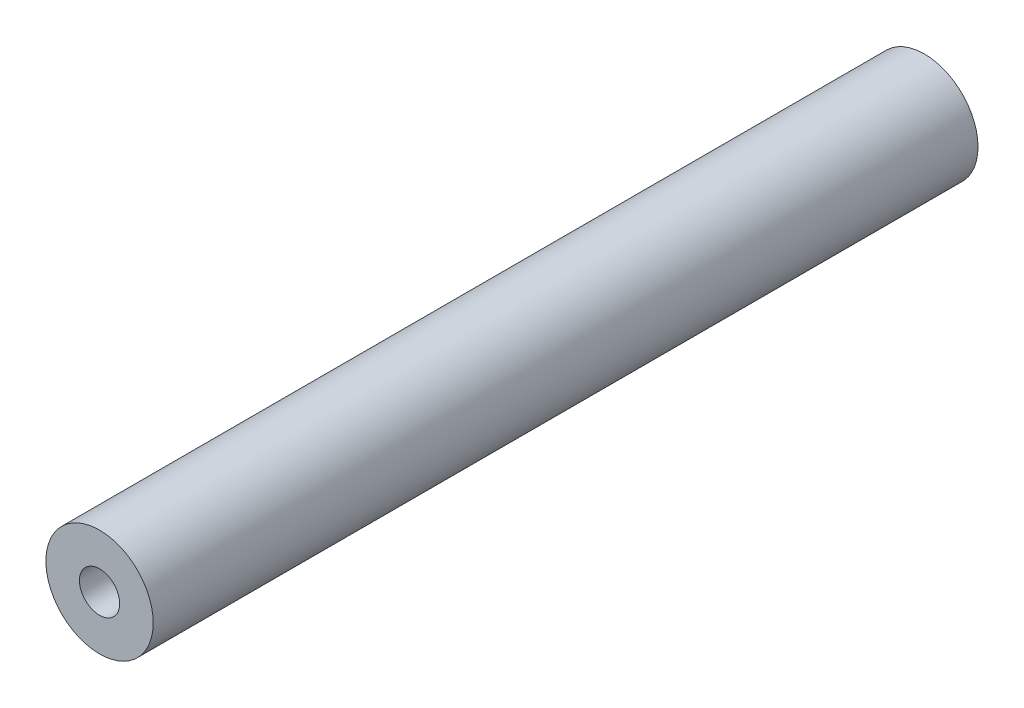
ISO-10303-21;
HEADER;
FILE_DESCRIPTION(('STEP AP214'),'2;1');
FILE_NAME('part.step','',(''),(''),'','','');
FILE_SCHEMA(('AUTOMOTIVE_DESIGN { 1 0 10303 214 1 1 1 1 }'));
ENDSEC;
DATA;
#1=APPLICATION_CONTEXT('core data for automotive mechanical design processes');
#2=APPLICATION_PROTOCOL_DEFINITION('international standard','automotive_design',2000,#1);
#3=PRODUCT_CONTEXT('',#1,'mechanical');
#4=PRODUCT('Part','Part','',(#3));
#5=PRODUCT_RELATED_PRODUCT_CATEGORY('part','',(#4));
#6=PRODUCT_DEFINITION_FORMATION('','',#4);
#7=PRODUCT_DEFINITION_CONTEXT('part definition',#1,'design');
#8=PRODUCT_DEFINITION('design','',#6,#7);
#9=PRODUCT_DEFINITION_SHAPE('','',#8);
#10=(LENGTH_UNIT() NAMED_UNIT(*) SI_UNIT(.MILLI.,.METRE.));
#11=(NAMED_UNIT(*) PLANE_ANGLE_UNIT() SI_UNIT($,.RADIAN.));
#12=(NAMED_UNIT(*) SI_UNIT($,.STERADIAN.) SOLID_ANGLE_UNIT());
#13=UNCERTAINTY_MEASURE_WITH_UNIT(LENGTH_MEASURE(1.E-05),#10,'distance_accuracy_value','');
#14=(GEOMETRIC_REPRESENTATION_CONTEXT(3) GLOBAL_UNCERTAINTY_ASSIGNED_CONTEXT((#13)) GLOBAL_UNIT_ASSIGNED_CONTEXT((#10,
#11,#12)) REPRESENTATION_CONTEXT('',''));
#15=CARTESIAN_POINT('',(0.,0.,0.));
#16=DIRECTION('',(0.,0.,1.));
#17=DIRECTION('',(1.,0.,0.));
#18=AXIS2_PLACEMENT_3D('',#15,#16,#17);
#19=CARTESIAN_POINT('',(0.,0.,123.));
#20=DIRECTION('',(0.,0.,-1.));
#21=DIRECTION('',(-1.,0.,0.));
#22=AXIS2_PLACEMENT_3D('',#19,#20,#21);
#23=CYLINDRICAL_SURFACE('',#22,8.);
#24=CARTESIAN_POINT('',(0.,0.,123.));
#25=DIRECTION('',(0.,0.,1.));
#26=DIRECTION('',(1.,0.,0.));
#27=AXIS2_PLACEMENT_3D('',#24,#25,#26);
#28=CIRCLE('',#27,8.);
#29=CARTESIAN_POINT('',(8.,0.,123.));
#30=VERTEX_POINT('',#29);
#31=EDGE_CURVE('E10',#30,#30,#28,.T.);
#32=ORIENTED_EDGE('',*,*,#31,.F.);
#33=EDGE_LOOP('',(#32));
#34=FACE_BOUND('',#33,.T.);
#35=CARTESIAN_POINT('',(0.,0.,0.));
#36=DIRECTION('',(0.,0.,1.));
#37=DIRECTION('',(1.,0.,0.));
#38=AXIS2_PLACEMENT_3D('',#35,#36,#37);
#39=CIRCLE('',#38,8.);
#40=CARTESIAN_POINT('',(8.,0.,0.));
#41=VERTEX_POINT('',#40);
#42=EDGE_CURVE('E33',#41,#41,#39,.T.);
#43=ORIENTED_EDGE('',*,*,#42,.T.);
#44=EDGE_LOOP('',(#43));
#45=FACE_BOUND('',#44,.T.);
#46=ADVANCED_FACE('F30',(#34,#45),#23,.T.);
#47=CARTESIAN_POINT('',(0.,0.,123.));
#48=DIRECTION('',(0.,0.,1.));
#49=DIRECTION('',(1.,0.,0.));
#50=AXIS2_PLACEMENT_3D('',#47,#48,#49);
#51=PLANE('',#50);
#52=CARTESIAN_POINT('',(0.,0.,123.));
#53=DIRECTION('',(0.,0.,1.));
#54=DIRECTION('',(1.,0.,0.));
#55=AXIS2_PLACEMENT_3D('',#52,#53,#54);
#56=CIRCLE('',#55,3.);
#57=CARTESIAN_POINT('',(3.,0.,123.));
#58=VERTEX_POINT('',#57);
#59=EDGE_CURVE('E42',#58,#58,#56,.T.);
#60=ORIENTED_EDGE('',*,*,#59,.F.);
#61=EDGE_LOOP('',(#60));
#62=FACE_BOUND('',#61,.T.);
#63=ORIENTED_EDGE('',*,*,#31,.T.);
#64=EDGE_LOOP('',(#63));
#65=FACE_BOUND('',#64,.T.);
#66=ADVANCED_FACE('F67',(#62,#65),#51,.T.);
#67=CARTESIAN_POINT('',(0.,0.,0.));
#68=DIRECTION('',(0.,0.,1.));
#69=DIRECTION('',(1.,0.,0.));
#70=AXIS2_PLACEMENT_3D('',#67,#68,#69);
#71=PLANE('',#70);
#72=CARTESIAN_POINT('',(0.,0.,0.));
#73=DIRECTION('',(0.,0.,-1.));
#74=DIRECTION('',(-1.,0.,0.));
#75=AXIS2_PLACEMENT_3D('',#72,#73,#74);
#76=CIRCLE('',#75,3.);
#77=CARTESIAN_POINT('',(-3.,0.,0.));
#78=VERTEX_POINT('',#77);
#79=EDGE_CURVE('E48',#78,#78,#76,.T.);
#80=ORIENTED_EDGE('',*,*,#79,.F.);
#81=EDGE_LOOP('',(#80));
#82=FACE_BOUND('',#81,.T.);
#83=ORIENTED_EDGE('',*,*,#42,.F.);
#84=EDGE_LOOP('',(#83));
#85=FACE_BOUND('',#84,.T.);
#86=ADVANCED_FACE('F63',(#82,#85),#71,.F.);
#87=CARTESIAN_POINT('',(0.,0.,108.));
#88=DIRECTION('',(0.,0.,1.));
#89=DIRECTION('',(1.,0.,0.));
#90=AXIS2_PLACEMENT_3D('',#87,#88,#89);
#91=CYLINDRICAL_SURFACE('',#90,3.);
#92=CARTESIAN_POINT('',(0.,0.,108.));
#93=DIRECTION('',(0.,0.,1.));
#94=DIRECTION('',(1.,0.,0.));
#95=AXIS2_PLACEMENT_3D('',#92,#93,#94);
#96=CIRCLE('',#95,3.);
#97=CARTESIAN_POINT('',(3.,0.,108.));
#98=VERTEX_POINT('',#97);
#99=EDGE_CURVE('E40',#98,#98,#96,.T.);
#100=ORIENTED_EDGE('',*,*,#99,.F.);
#101=EDGE_LOOP('',(#100));
#102=FACE_BOUND('',#101,.T.);
#103=ORIENTED_EDGE('',*,*,#59,.T.);
#104=EDGE_LOOP('',(#103));
#105=FACE_BOUND('',#104,.T.);
#106=ADVANCED_FACE('F66',(#102,#105),#91,.F.);
#107=CARTESIAN_POINT('',(0.,0.,108.));
#108=DIRECTION('',(0.,0.,1.));
#109=DIRECTION('',(1.,0.,0.));
#110=AXIS2_PLACEMENT_3D('',#107,#108,#109);
#111=PLANE('',#110);
#112=ORIENTED_EDGE('',*,*,#99,.T.);
#113=EDGE_LOOP('',(#112));
#114=FACE_BOUND('',#113,.T.);
#115=ADVANCED_FACE('F59',(#114),#111,.T.);
#116=CARTESIAN_POINT('',(0.,0.,15.));
#117=DIRECTION('',(0.,0.,-1.));
#118=DIRECTION('',(-1.,0.,0.));
#119=AXIS2_PLACEMENT_3D('',#116,#117,#118);
#120=CYLINDRICAL_SURFACE('',#119,3.);
#121=CARTESIAN_POINT('',(0.,0.,15.));
#122=DIRECTION('',(0.,0.,-1.));
#123=DIRECTION('',(-1.,0.,0.));
#124=AXIS2_PLACEMENT_3D('',#121,#122,#123);
#125=CIRCLE('',#124,3.);
#126=CARTESIAN_POINT('',(-3.,0.,15.));
#127=VERTEX_POINT('',#126);
#128=EDGE_CURVE('E45',#127,#127,#125,.T.);
#129=ORIENTED_EDGE('',*,*,#128,.F.);
#130=EDGE_LOOP('',(#129));
#131=FACE_BOUND('',#130,.T.);
#132=ORIENTED_EDGE('',*,*,#79,.T.);
#133=EDGE_LOOP('',(#132));
#134=FACE_BOUND('',#133,.T.);
#135=ADVANCED_FACE('F56',(#131,#134),#120,.F.);
#136=CARTESIAN_POINT('',(0.,0.,15.));
#137=DIRECTION('',(0.,0.,-1.));
#138=DIRECTION('',(-1.,0.,0.));
#139=AXIS2_PLACEMENT_3D('',#136,#137,#138);
#140=PLANE('',#139);
#141=ORIENTED_EDGE('',*,*,#128,.T.);
#142=EDGE_LOOP('',(#141));
#143=FACE_BOUND('',#142,.T.);
#144=ADVANCED_FACE('F54',(#143),#140,.T.);
#145=CLOSED_SHELL('',(#46,#66,#86,#106,#115,#135,#144));
#146=MANIFOLD_SOLID_BREP('B2',#145);
#147=ADVANCED_BREP_SHAPE_REPRESENTATION('',(#18,#146),#14);
#148=SHAPE_DEFINITION_REPRESENTATION(#9,#147);
ENDSEC;
END-ISO-10303-21;
